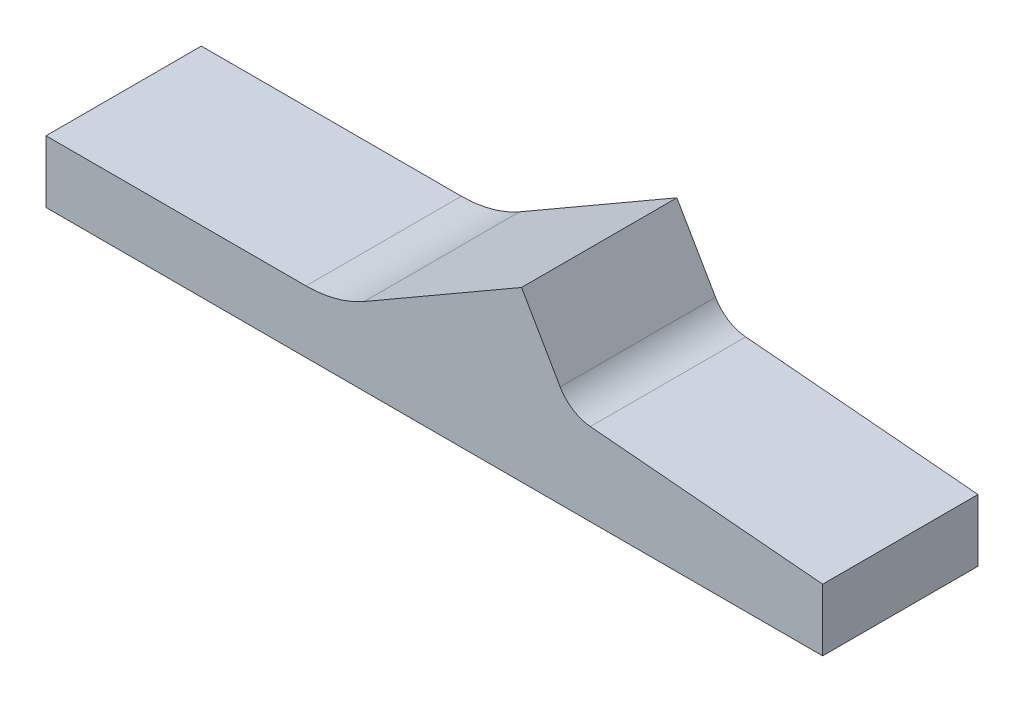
ISO-10303-21;
HEADER;
FILE_DESCRIPTION(('STEP AP214'),'2;1');
FILE_NAME('part.step','',(''),(''),'','','');
FILE_SCHEMA(('AUTOMOTIVE_DESIGN { 1 0 10303 214 1 1 1 1 }'));
ENDSEC;
DATA;
#1=APPLICATION_CONTEXT('core data for automotive mechanical design processes');
#2=APPLICATION_PROTOCOL_DEFINITION('international standard','automotive_design',2000,#1);
#3=PRODUCT_CONTEXT('',#1,'mechanical');
#4=PRODUCT('Part','Part','',(#3));
#5=PRODUCT_RELATED_PRODUCT_CATEGORY('part','',(#4));
#6=PRODUCT_DEFINITION_FORMATION('','',#4);
#7=PRODUCT_DEFINITION_CONTEXT('part definition',#1,'design');
#8=PRODUCT_DEFINITION('design','',#6,#7);
#9=PRODUCT_DEFINITION_SHAPE('','',#8);
#10=(LENGTH_UNIT() NAMED_UNIT(*) SI_UNIT(.MILLI.,.METRE.));
#11=(NAMED_UNIT(*) PLANE_ANGLE_UNIT() SI_UNIT($,.RADIAN.));
#12=(NAMED_UNIT(*) SI_UNIT($,.STERADIAN.) SOLID_ANGLE_UNIT());
#13=UNCERTAINTY_MEASURE_WITH_UNIT(LENGTH_MEASURE(1.E-05),#10,'distance_accuracy_value','');
#14=(GEOMETRIC_REPRESENTATION_CONTEXT(3) GLOBAL_UNCERTAINTY_ASSIGNED_CONTEXT((#13)) GLOBAL_UNIT_ASSIGNED_CONTEXT((#10,
#11,#12)) REPRESENTATION_CONTEXT('',''));
#15=CARTESIAN_POINT('',(0.,0.,0.));
#16=DIRECTION('',(0.,0.,1.));
#17=DIRECTION('',(1.,0.,0.));
#18=AXIS2_PLACEMENT_3D('',#15,#16,#17);
#19=CARTESIAN_POINT('',(0.,-16.,20.));
#20=DIRECTION('',(1.,0.,0.));
#21=DIRECTION('',(0.,0.,-1.));
#22=AXIS2_PLACEMENT_3D('',#19,#20,#21);
#23=PLANE('',#22);
#24=DIRECTION('',(0.,-1.,0.));
#25=VECTOR('',#24,1.);
#26=CARTESIAN_POINT('',(0.,-16.,-20.));
#27=LINE('',#26,#25);
#28=CARTESIAN_POINT('',(0.,0.,-20.));
#29=VERTEX_POINT('',#28);
#30=CARTESIAN_POINT('',(0.,-16.,-20.));
#31=VERTEX_POINT('',#30);
#32=EDGE_CURVE('E134',#29,#31,#27,.T.);
#33=ORIENTED_EDGE('',*,*,#32,.T.);
#34=DIRECTION('',(0.,0.,-1.));
#35=VECTOR('',#34,1.);
#36=CARTESIAN_POINT('',(0.,-16.,20.));
#37=LINE('',#36,#35);
#38=CARTESIAN_POINT('',(0.,-16.,20.));
#39=VERTEX_POINT('',#38);
#40=EDGE_CURVE('E11',#39,#31,#37,.T.);
#41=ORIENTED_EDGE('',*,*,#40,.F.);
#42=DIRECTION('',(0.,-1.,0.));
#43=VECTOR('',#42,1.);
#44=CARTESIAN_POINT('',(0.,-16.,20.));
#45=LINE('',#44,#43);
#46=CARTESIAN_POINT('',(0.,0.,20.));
#47=VERTEX_POINT('',#46);
#48=EDGE_CURVE('E150',#47,#39,#45,.T.);
#49=ORIENTED_EDGE('',*,*,#48,.F.);
#50=DIRECTION('',(0.,0.,-1.));
#51=VECTOR('',#50,1.);
#52=CARTESIAN_POINT('',(0.,0.,20.));
#53=LINE('',#52,#51);
#54=EDGE_CURVE('E130',#47,#29,#53,.T.);
#55=ORIENTED_EDGE('',*,*,#54,.T.);
#56=EDGE_LOOP('',(#33,#41,#49,#55));
#57=FACE_BOUND('',#56,.T.);
#58=ADVANCED_FACE('F32',(#57),#23,.F.);
#59=CARTESIAN_POINT('',(200.,-16.,20.));
#60=DIRECTION('',(0.,1.,0.));
#61=DIRECTION('',(-1.,0.,0.));
#62=AXIS2_PLACEMENT_3D('',#59,#60,#61);
#63=PLANE('',#62);
#64=DIRECTION('',(1.,0.,0.));
#65=VECTOR('',#64,1.);
#66=CARTESIAN_POINT('',(200.,-16.,-20.));
#67=LINE('',#66,#65);
#68=CARTESIAN_POINT('',(200.,-16.,-20.));
#69=VERTEX_POINT('',#68);
#70=EDGE_CURVE('E137',#31,#69,#67,.T.);
#71=ORIENTED_EDGE('',*,*,#70,.T.);
#72=DIRECTION('',(0.,0.,-1.));
#73=VECTOR('',#72,1.);
#74=CARTESIAN_POINT('',(200.,-16.,20.));
#75=LINE('',#74,#73);
#76=CARTESIAN_POINT('',(200.,-16.,20.));
#77=VERTEX_POINT('',#76);
#78=EDGE_CURVE('E40',#77,#69,#75,.T.);
#79=ORIENTED_EDGE('',*,*,#78,.F.);
#80=DIRECTION('',(1.,0.,0.));
#81=VECTOR('',#80,1.);
#82=CARTESIAN_POINT('',(200.,-16.,20.));
#83=LINE('',#82,#81);
#84=EDGE_CURVE('E94',#39,#77,#83,.T.);
#85=ORIENTED_EDGE('',*,*,#84,.F.);
#86=ORIENTED_EDGE('',*,*,#40,.T.);
#87=EDGE_LOOP('',(#71,#79,#85,#86));
#88=FACE_BOUND('',#87,.T.);
#89=ADVANCED_FACE('F193',(#88),#63,.F.);
#90=CARTESIAN_POINT('',(200.,0.,20.));
#91=DIRECTION('',(-1.,0.,0.));
#92=DIRECTION('',(0.,0.,1.));
#93=AXIS2_PLACEMENT_3D('',#90,#91,#92);
#94=PLANE('',#93);
#95=DIRECTION('',(0.,1.,0.));
#96=VECTOR('',#95,1.);
#97=CARTESIAN_POINT('',(200.,0.,-20.));
#98=LINE('',#97,#96);
#99=CARTESIAN_POINT('',(200.,0.,-20.));
#100=VERTEX_POINT('',#99);
#101=EDGE_CURVE('E139',#69,#100,#98,.T.);
#102=ORIENTED_EDGE('',*,*,#101,.T.);
#103=DIRECTION('',(0.,0.,-1.));
#104=VECTOR('',#103,1.);
#105=CARTESIAN_POINT('',(200.,0.,20.));
#106=LINE('',#105,#104);
#107=CARTESIAN_POINT('',(200.,0.,20.));
#108=VERTEX_POINT('',#107);
#109=EDGE_CURVE('E160',#108,#100,#106,.T.);
#110=ORIENTED_EDGE('',*,*,#109,.F.);
#111=DIRECTION('',(0.,1.,0.));
#112=VECTOR('',#111,1.);
#113=CARTESIAN_POINT('',(200.,0.,20.));
#114=LINE('',#113,#112);
#115=EDGE_CURVE('E168',#77,#108,#114,.T.);
#116=ORIENTED_EDGE('',*,*,#115,.F.);
#117=ORIENTED_EDGE('',*,*,#78,.T.);
#118=EDGE_LOOP('',(#102,#110,#116,#117));
#119=FACE_BOUND('',#118,.T.);
#120=ADVANCED_FACE('F166',(#119),#94,.F.);
#121=CARTESIAN_POINT('',(140.185861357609,5.23305904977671,20.));
#122=DIRECTION('',(-0.0871557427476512,-0.996194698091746,0.));
#123=DIRECTION('',(0.996194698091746,-0.0871557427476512,0.));
#124=AXIS2_PLACEMENT_3D('',#121,#122,#123);
#125=PLANE('',#124);
#126=DIRECTION('',(-0.996194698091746,0.0871557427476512,0.));
#127=VECTOR('',#126,1.);
#128=CARTESIAN_POINT('',(140.185861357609,5.23305904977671,-20.));
#129=LINE('',#128,#127);
#130=CARTESIAN_POINT('',(140.185861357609,5.2330590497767,-20.));
#131=VERTEX_POINT('',#130);
#132=EDGE_CURVE('E141',#100,#131,#129,.T.);
#133=ORIENTED_EDGE('',*,*,#132,.T.);
#134=DIRECTION('',(0.,0.,-1.));
#135=VECTOR('',#134,1.);
#136=CARTESIAN_POINT('',(140.185861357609,5.2330590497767,20.));
#137=LINE('',#136,#135);
#138=CARTESIAN_POINT('',(140.185861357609,5.2330590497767,20.));
#139=VERTEX_POINT('',#138);
#140=EDGE_CURVE('E157',#139,#131,#137,.T.);
#141=ORIENTED_EDGE('',*,*,#140,.F.);
#142=DIRECTION('',(-0.996194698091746,0.0871557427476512,0.));
#143=VECTOR('',#142,1.);
#144=CARTESIAN_POINT('',(140.185861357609,5.23305904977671,20.));
#145=LINE('',#144,#143);
#146=EDGE_CURVE('E184',#108,#139,#145,.T.);
#147=ORIENTED_EDGE('',*,*,#146,.F.);
#148=ORIENTED_EDGE('',*,*,#109,.T.);
#149=EDGE_LOOP('',(#133,#141,#147,#148));
#150=FACE_BOUND('',#149,.T.);
#151=ADVANCED_FACE('F177',(#150),#125,.F.);
#152=CARTESIAN_POINT('',(141.057418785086,15.1950060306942,20.));
#153=DIRECTION('',(0.,0.,-1.));
#154=DIRECTION('',(-1.,0.,0.));
#155=AXIS2_PLACEMENT_3D('',#152,#153,#154);
#156=CYLINDRICAL_SURFACE('',#155,10.);
#157=CARTESIAN_POINT('',(141.057418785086,15.1950060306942,-20.));
#158=DIRECTION('',(0.,0.,-1.));
#159=DIRECTION('',(1.,0.,0.));
#160=AXIS2_PLACEMENT_3D('',#157,#158,#159);
#161=CIRCLE('',#160,10.);
#162=CARTESIAN_POINT('',(132.397164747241,10.1950060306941,-20.));
#163=VERTEX_POINT('',#162);
#164=EDGE_CURVE('E143',#131,#163,#161,.T.);
#165=ORIENTED_EDGE('',*,*,#164,.T.);
#166=DIRECTION('',(0.,0.,-1.));
#167=VECTOR('',#166,1.);
#168=CARTESIAN_POINT('',(132.397164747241,10.1950060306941,20.));
#169=LINE('',#168,#167);
#170=CARTESIAN_POINT('',(132.397164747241,10.1950060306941,20.));
#171=VERTEX_POINT('',#170);
#172=EDGE_CURVE('E154',#171,#163,#169,.T.);
#173=ORIENTED_EDGE('',*,*,#172,.F.);
#174=CARTESIAN_POINT('',(141.057418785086,15.1950060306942,20.));
#175=DIRECTION('',(0.,0.,-1.));
#176=DIRECTION('',(1.,0.,0.));
#177=AXIS2_PLACEMENT_3D('',#174,#175,#176);
#178=CIRCLE('',#177,10.);
#179=EDGE_CURVE('E183',#139,#171,#178,.T.);
#180=ORIENTED_EDGE('',*,*,#179,.F.);
#181=ORIENTED_EDGE('',*,*,#140,.T.);
#182=EDGE_LOOP('',(#165,#173,#180,#181));
#183=FACE_BOUND('',#182,.T.);
#184=ADVANCED_FACE('F181',(#183),#156,.F.);
#185=CARTESIAN_POINT('',(122.462440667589,27.402452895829,20.));
#186=DIRECTION('',(-0.866025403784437,-0.500000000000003,0.));
#187=DIRECTION('',(0.500000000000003,-0.866025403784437,0.));
#188=AXIS2_PLACEMENT_3D('',#185,#186,#187);
#189=PLANE('',#188);
#190=DIRECTION('',(-0.500000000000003,0.866025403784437,0.));
#191=VECTOR('',#190,1.);
#192=CARTESIAN_POINT('',(122.462440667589,27.402452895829,-20.));
#193=LINE('',#192,#191);
#194=CARTESIAN_POINT('',(122.462440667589,27.402452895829,-20.));
#195=VERTEX_POINT('',#194);
#196=EDGE_CURVE('E145',#163,#195,#193,.T.);
#197=ORIENTED_EDGE('',*,*,#196,.T.);
#198=DIRECTION('',(0.,0.,-1.));
#199=VECTOR('',#198,1.);
#200=CARTESIAN_POINT('',(122.462440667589,27.402452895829,20.));
#201=LINE('',#200,#199);
#202=CARTESIAN_POINT('',(122.462440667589,27.402452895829,20.));
#203=VERTEX_POINT('',#202);
#204=EDGE_CURVE('E125',#203,#195,#201,.T.);
#205=ORIENTED_EDGE('',*,*,#204,.F.);
#206=DIRECTION('',(-0.500000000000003,0.866025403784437,0.));
#207=VECTOR('',#206,1.);
#208=CARTESIAN_POINT('',(122.462440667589,27.402452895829,20.));
#209=LINE('',#208,#207);
#210=EDGE_CURVE('E116',#171,#203,#209,.T.);
#211=ORIENTED_EDGE('',*,*,#210,.F.);
#212=ORIENTED_EDGE('',*,*,#172,.T.);
#213=EDGE_LOOP('',(#197,#205,#211,#212));
#214=FACE_BOUND('',#213,.T.);
#215=ADVANCED_FACE('F205',(#214),#189,.F.);
#216=CARTESIAN_POINT('',(81.9615242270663,4.01923788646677,20.));
#217=DIRECTION('',(0.499999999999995,-0.866025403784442,0.));
#218=DIRECTION('',(0.866025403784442,0.499999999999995,0.));
#219=AXIS2_PLACEMENT_3D('',#216,#217,#218);
#220=PLANE('',#219);
#221=DIRECTION('',(-0.866025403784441,-0.499999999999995,0.));
#222=VECTOR('',#221,1.);
#223=CARTESIAN_POINT('',(81.9615242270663,4.01923788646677,-20.));
#224=LINE('',#223,#222);
#225=CARTESIAN_POINT('',(81.9615242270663,4.01923788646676,-20.));
#226=VERTEX_POINT('',#225);
#227=EDGE_CURVE('E124',#195,#226,#224,.T.);
#228=ORIENTED_EDGE('',*,*,#227,.T.);
#229=DIRECTION('',(0.,0.,-1.));
#230=VECTOR('',#229,1.);
#231=CARTESIAN_POINT('',(81.9615242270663,4.01923788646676,20.));
#232=LINE('',#231,#230);
#233=CARTESIAN_POINT('',(81.9615242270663,4.01923788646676,20.));
#234=VERTEX_POINT('',#233);
#235=EDGE_CURVE('E121',#234,#226,#232,.T.);
#236=ORIENTED_EDGE('',*,*,#235,.F.);
#237=DIRECTION('',(-0.866025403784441,-0.499999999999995,0.));
#238=VECTOR('',#237,1.);
#239=CARTESIAN_POINT('',(81.9615242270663,4.01923788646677,20.));
#240=LINE('',#239,#238);
#241=EDGE_CURVE('E110',#203,#234,#240,.T.);
#242=ORIENTED_EDGE('',*,*,#241,.F.);
#243=ORIENTED_EDGE('',*,*,#204,.T.);
#244=EDGE_LOOP('',(#228,#236,#242,#243));
#245=FACE_BOUND('',#244,.T.);
#246=ADVANCED_FACE('F122',(#245),#220,.F.);
#247=CARTESIAN_POINT('',(66.9615242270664,30.,20.));
#248=DIRECTION('',(0.,0.,-1.));
#249=DIRECTION('',(-1.,0.,0.));
#250=AXIS2_PLACEMENT_3D('',#247,#248,#249);
#251=CYLINDRICAL_SURFACE('',#250,30.);
#252=CARTESIAN_POINT('',(66.9615242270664,30.,-20.));
#253=DIRECTION('',(0.,0.,-1.));
#254=DIRECTION('',(1.,0.,0.));
#255=AXIS2_PLACEMENT_3D('',#252,#253,#254);
#256=CIRCLE('',#255,30.);
#257=CARTESIAN_POINT('',(66.9615242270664,0.,-20.));
#258=VERTEX_POINT('',#257);
#259=EDGE_CURVE('E80',#226,#258,#256,.T.);
#260=ORIENTED_EDGE('',*,*,#259,.T.);
#261=DIRECTION('',(0.,0.,-1.));
#262=VECTOR('',#261,1.);
#263=CARTESIAN_POINT('',(66.9615242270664,0.,20.));
#264=LINE('',#263,#262);
#265=CARTESIAN_POINT('',(66.9615242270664,0.,20.));
#266=VERTEX_POINT('',#265);
#267=EDGE_CURVE('E126',#266,#258,#264,.T.);
#268=ORIENTED_EDGE('',*,*,#267,.F.);
#269=CARTESIAN_POINT('',(66.9615242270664,30.,20.));
#270=DIRECTION('',(0.,0.,-1.));
#271=DIRECTION('',(1.,0.,0.));
#272=AXIS2_PLACEMENT_3D('',#269,#270,#271);
#273=CIRCLE('',#272,30.);
#274=EDGE_CURVE('E114',#234,#266,#273,.T.);
#275=ORIENTED_EDGE('',*,*,#274,.F.);
#276=ORIENTED_EDGE('',*,*,#235,.T.);
#277=EDGE_LOOP('',(#260,#268,#275,#276));
#278=FACE_BOUND('',#277,.T.);
#279=ADVANCED_FACE('F128',(#278),#251,.F.);
#280=CARTESIAN_POINT('',(0.,0.,20.));
#281=DIRECTION('',(0.,-1.,0.));
#282=DIRECTION('',(0.,0.,-1.));
#283=AXIS2_PLACEMENT_3D('',#280,#281,#282);
#284=PLANE('',#283);
#285=DIRECTION('',(-1.,0.,0.));
#286=VECTOR('',#285,1.);
#287=CARTESIAN_POINT('',(0.,0.,-20.));
#288=LINE('',#287,#286);
#289=EDGE_CURVE('E86',#258,#29,#288,.T.);
#290=ORIENTED_EDGE('',*,*,#289,.T.);
#291=ORIENTED_EDGE('',*,*,#54,.F.);
#292=DIRECTION('',(-1.,0.,0.));
#293=VECTOR('',#292,1.);
#294=CARTESIAN_POINT('',(0.,0.,20.));
#295=LINE('',#294,#293);
#296=EDGE_CURVE('E48',#266,#47,#295,.T.);
#297=ORIENTED_EDGE('',*,*,#296,.F.);
#298=ORIENTED_EDGE('',*,*,#267,.T.);
#299=EDGE_LOOP('',(#290,#291,#297,#298));
#300=FACE_BOUND('',#299,.T.);
#301=ADVANCED_FACE('F213',(#300),#284,.F.);
#302=CARTESIAN_POINT('',(66.9615242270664,30.,20.));
#303=DIRECTION('',(0.,0.,1.));
#304=DIRECTION('',(1.,0.,0.));
#305=AXIS2_PLACEMENT_3D('',#302,#303,#304);
#306=PLANE('',#305);
#307=ORIENTED_EDGE('',*,*,#48,.T.);
#308=ORIENTED_EDGE('',*,*,#84,.T.);
#309=ORIENTED_EDGE('',*,*,#115,.T.);
#310=ORIENTED_EDGE('',*,*,#146,.T.);
#311=ORIENTED_EDGE('',*,*,#179,.T.);
#312=ORIENTED_EDGE('',*,*,#210,.T.);
#313=ORIENTED_EDGE('',*,*,#241,.T.);
#314=ORIENTED_EDGE('',*,*,#274,.T.);
#315=ORIENTED_EDGE('',*,*,#296,.T.);
#316=EDGE_LOOP('',(#307,#308,#309,#310,#311,#312,#313,#314,#315));
#317=FACE_BOUND('',#316,.T.);
#318=ADVANCED_FACE('F112',(#317),#306,.T.);
#319=CARTESIAN_POINT('',(66.9615242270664,30.,-20.));
#320=DIRECTION('',(0.,0.,1.));
#321=DIRECTION('',(1.,0.,0.));
#322=AXIS2_PLACEMENT_3D('',#319,#320,#321);
#323=PLANE('',#322);
#324=ORIENTED_EDGE('',*,*,#32,.F.);
#325=ORIENTED_EDGE('',*,*,#289,.F.);
#326=ORIENTED_EDGE('',*,*,#259,.F.);
#327=ORIENTED_EDGE('',*,*,#227,.F.);
#328=ORIENTED_EDGE('',*,*,#196,.F.);
#329=ORIENTED_EDGE('',*,*,#164,.F.);
#330=ORIENTED_EDGE('',*,*,#132,.F.);
#331=ORIENTED_EDGE('',*,*,#101,.F.);
#332=ORIENTED_EDGE('',*,*,#70,.F.);
#333=EDGE_LOOP('',(#324,#325,#326,#327,#328,#329,#330,#331,#332));
#334=FACE_BOUND('',#333,.T.);
#335=ADVANCED_FACE('F172',(#334),#323,.F.);
#336=CLOSED_SHELL('',(#58,#89,#120,#151,#184,#215,#246,#279,#301,#318,#335));
#337=MANIFOLD_SOLID_BREP('B2',#336);
#338=ADVANCED_BREP_SHAPE_REPRESENTATION('',(#18,#337),#14);
#339=SHAPE_DEFINITION_REPRESENTATION(#9,#338);
ENDSEC;
END-ISO-10303-21;
